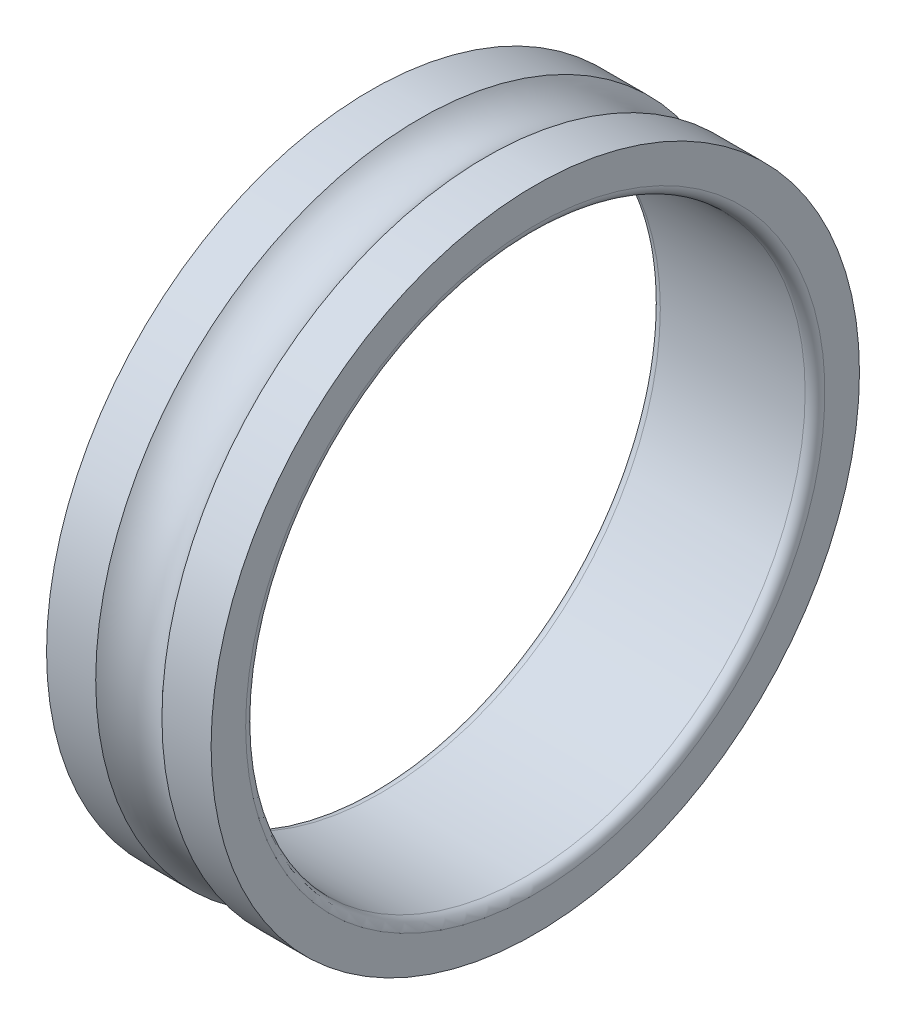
from build123d import *


with BuildPart() as part:
    # Esquisse1 → Base-R_volution (revolve)
    with BuildSketch(Plane(origin=(0, 0, 0), x_dir=(1, 0, 0), z_dir=(0, 1, 0)), mode=Mode.PRIVATE) as base_r_volution_sk:
        with BuildLine():
            Line((0, 9.85), (0, 8.8))
            ThreePointArc((0, 8.8), (0.087867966, 8.587867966), (0.3, 8.5))
            Line((0.3, 8.5), (4.7, 8.5))
            ThreePointArc((4.7, 8.5), (4.912132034, 8.587867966), (5, 8.8))
            Line((5, 8.8), (5, 9.85))
            Line((5, 9.85), (3.50623059, 9.85))
            ThreePointArc((3.50623059, 9.85), (2.5, 9.4), (1.49376941, 9.85))
            Line((1.49376941, 9.85), (0, 9.85))
        make_face()
    revolve(base_r_volution_sk.sketch.rotate(Axis((0, 0, 0), (1, 0, 0)), 180), axis=Axis((0, 0, 0), (1, 0, 0)))


solid = part.part
